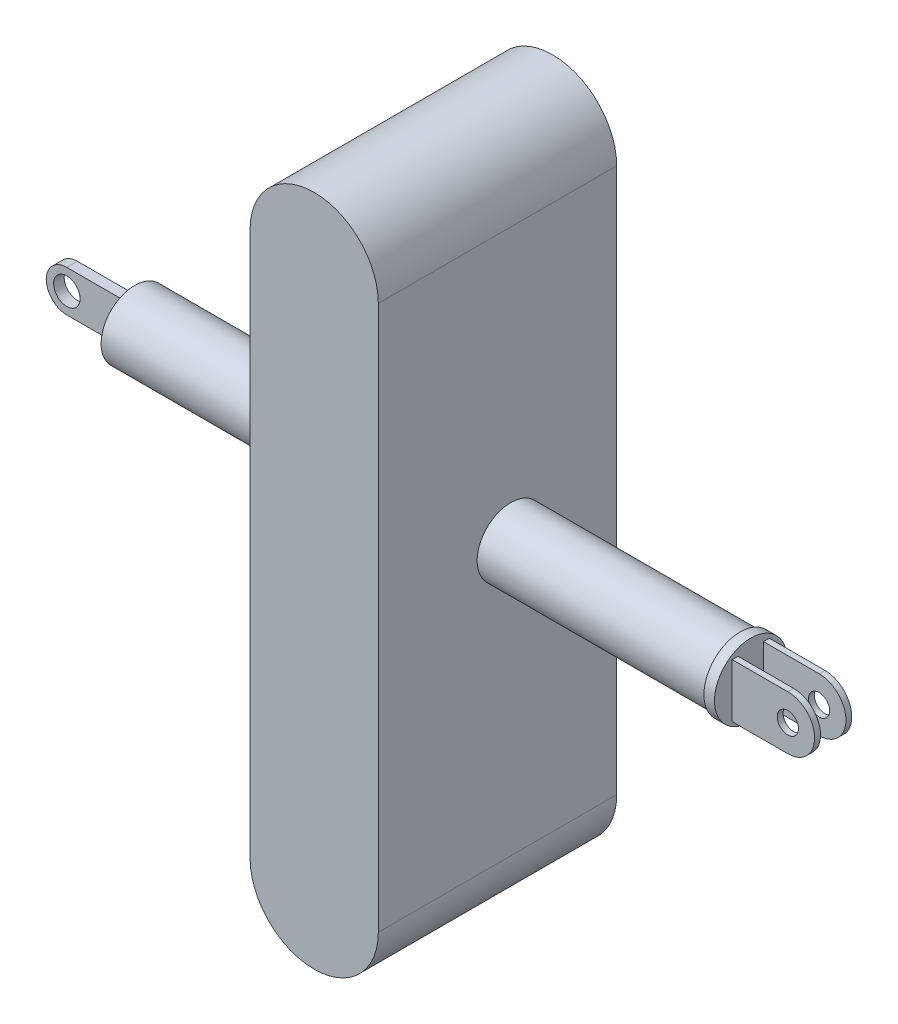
ISO-10303-21;
HEADER;
FILE_DESCRIPTION(('STEP AP214'),'2;1');
FILE_NAME('part.step','',(''),(''),'','','');
FILE_SCHEMA(('AUTOMOTIVE_DESIGN { 1 0 10303 214 1 1 1 1 }'));
ENDSEC;
DATA;
#1=APPLICATION_CONTEXT('core data for automotive mechanical design processes');
#2=APPLICATION_PROTOCOL_DEFINITION('international standard','automotive_design',2000,#1);
#3=PRODUCT_CONTEXT('',#1,'mechanical');
#4=PRODUCT('Part','Part','',(#3));
#5=PRODUCT_RELATED_PRODUCT_CATEGORY('part','',(#4));
#6=PRODUCT_DEFINITION_FORMATION('','',#4);
#7=PRODUCT_DEFINITION_CONTEXT('part definition',#1,'design');
#8=PRODUCT_DEFINITION('design','',#6,#7);
#9=PRODUCT_DEFINITION_SHAPE('','',#8);
#10=(LENGTH_UNIT() NAMED_UNIT(*) SI_UNIT(.MILLI.,.METRE.));
#11=(NAMED_UNIT(*) PLANE_ANGLE_UNIT() SI_UNIT($,.RADIAN.));
#12=(NAMED_UNIT(*) SI_UNIT($,.STERADIAN.) SOLID_ANGLE_UNIT());
#13=UNCERTAINTY_MEASURE_WITH_UNIT(LENGTH_MEASURE(1.E-05),#10,'distance_accuracy_value','');
#14=(GEOMETRIC_REPRESENTATION_CONTEXT(3) GLOBAL_UNCERTAINTY_ASSIGNED_CONTEXT((#13)) GLOBAL_UNIT_ASSIGNED_CONTEXT((#10,
#11,#12)) REPRESENTATION_CONTEXT('',''));
#15=CARTESIAN_POINT('',(0.,0.,0.));
#16=DIRECTION('',(0.,0.,1.));
#17=DIRECTION('',(1.,0.,0.));
#18=AXIS2_PLACEMENT_3D('',#15,#16,#17);
#19=CARTESIAN_POINT('',(228.6,0.,0.));
#20=DIRECTION('',(-1.,0.,0.));
#21=DIRECTION('',(0.,0.,1.));
#22=AXIS2_PLACEMENT_3D('',#19,#20,#21);
#23=CYLINDRICAL_SURFACE('',#22,12.7);
#24=CARTESIAN_POINT('',(228.6,0.,0.));
#25=DIRECTION('',(1.,0.,0.));
#26=DIRECTION('',(0.,0.,-1.));
#27=AXIS2_PLACEMENT_3D('',#24,#25,#26);
#28=CIRCLE('',#27,12.7);
#29=CARTESIAN_POINT('',(228.6,0.,12.7));
#30=VERTEX_POINT('',#29);
#31=EDGE_CURVE('E48',#30,#30,#28,.T.);
#32=CARTESIAN_POINT('',(141.979005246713,0.,0.));
#33=DIRECTION('',(-1.,0.,0.));
#34=DIRECTION('',(0.,0.,1.));
#35=AXIS2_PLACEMENT_3D('',#32,#33,#34);
#36=CIRCLE('',#35,12.7);
#37=CARTESIAN_POINT('',(141.979005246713,0.,12.7));
#38=VERTEX_POINT('',#37);
#39=EDGE_CURVE('E11',#38,#38,#36,.T.);
#40=CARTESIAN_POINT('',(228.6,0.,12.7));
#41=CARTESIAN_POINT('',(227.69769797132,0.,12.7));
#42=CARTESIAN_POINT('',(226.79539594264,0.,12.7));
#43=CARTESIAN_POINT('',(224.99079188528,0.,12.7));
#44=CARTESIAN_POINT('',(224.0884898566,0.,12.7));
#45=CARTESIAN_POINT('',(222.283885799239,0.,12.7));
#46=CARTESIAN_POINT('',(221.381583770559,0.,12.7));
#47=CARTESIAN_POINT('',(219.576979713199,0.,12.7));
#48=CARTESIAN_POINT('',(218.674677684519,0.,12.7));
#49=CARTESIAN_POINT('',(216.870073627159,0.,12.7));
#50=CARTESIAN_POINT('',(215.967771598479,0.,12.7));
#51=CARTESIAN_POINT('',(214.163167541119,0.,12.7));
#52=CARTESIAN_POINT('',(213.260865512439,0.,12.7));
#53=CARTESIAN_POINT('',(211.456261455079,0.,12.7));
#54=CARTESIAN_POINT('',(210.553959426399,0.,12.7));
#55=CARTESIAN_POINT('',(208.749355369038,0.,12.7));
#56=CARTESIAN_POINT('',(207.847053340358,0.,12.7));
#57=CARTESIAN_POINT('',(206.042449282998,0.,12.7));
#58=CARTESIAN_POINT('',(205.140147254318,0.,12.7));
#59=CARTESIAN_POINT('',(203.335543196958,0.,12.7));
#60=CARTESIAN_POINT('',(202.433241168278,0.,12.7));
#61=CARTESIAN_POINT('',(200.628637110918,0.,12.7));
#62=CARTESIAN_POINT('',(199.726335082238,0.,12.7));
#63=CARTESIAN_POINT('',(197.921731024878,0.,12.7));
#64=CARTESIAN_POINT('',(197.019428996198,0.,12.7));
#65=CARTESIAN_POINT('',(195.214824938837,0.,12.7));
#66=CARTESIAN_POINT('',(194.312522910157,0.,12.7));
#67=CARTESIAN_POINT('',(192.507918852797,0.,12.7));
#68=CARTESIAN_POINT('',(191.605616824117,0.,12.7));
#69=CARTESIAN_POINT('',(189.801012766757,0.,12.7));
#70=CARTESIAN_POINT('',(188.898710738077,0.,12.7));
#71=CARTESIAN_POINT('',(187.094106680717,0.,12.7));
#72=CARTESIAN_POINT('',(186.191804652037,0.,12.7));
#73=CARTESIAN_POINT('',(184.387200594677,0.,12.7));
#74=CARTESIAN_POINT('',(183.484898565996,0.,12.7));
#75=CARTESIAN_POINT('',(181.680294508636,0.,12.7));
#76=CARTESIAN_POINT('',(180.777992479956,0.,12.7));
#77=CARTESIAN_POINT('',(178.973388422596,0.,12.7));
#78=CARTESIAN_POINT('',(178.071086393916,0.,12.7));
#79=CARTESIAN_POINT('',(176.266482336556,0.,12.7));
#80=CARTESIAN_POINT('',(175.364180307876,0.,12.7));
#81=CARTESIAN_POINT('',(173.559576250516,0.,12.7));
#82=CARTESIAN_POINT('',(172.657274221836,0.,12.7));
#83=CARTESIAN_POINT('',(170.852670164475,0.,12.7));
#84=CARTESIAN_POINT('',(169.950368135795,0.,12.7));
#85=CARTESIAN_POINT('',(168.145764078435,0.,12.7));
#86=CARTESIAN_POINT('',(167.243462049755,0.,12.7));
#87=CARTESIAN_POINT('',(165.438857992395,0.,12.7));
#88=CARTESIAN_POINT('',(164.536555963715,0.,12.7));
#89=CARTESIAN_POINT('',(162.731951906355,0.,12.7));
#90=CARTESIAN_POINT('',(161.829649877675,0.,12.7));
#91=CARTESIAN_POINT('',(160.025045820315,0.,12.7));
#92=CARTESIAN_POINT('',(159.122743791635,0.,12.7));
#93=CARTESIAN_POINT('',(157.318139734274,0.,12.7));
#94=CARTESIAN_POINT('',(156.415837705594,0.,12.7));
#95=CARTESIAN_POINT('',(154.611233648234,0.,12.7));
#96=CARTESIAN_POINT('',(153.708931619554,0.,12.7));
#97=CARTESIAN_POINT('',(151.904327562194,0.,12.7));
#98=CARTESIAN_POINT('',(151.002025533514,0.,12.7));
#99=CARTESIAN_POINT('',(149.197421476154,0.,12.7));
#100=CARTESIAN_POINT('',(148.295119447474,0.,12.7));
#101=CARTESIAN_POINT('',(146.490515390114,0.,12.7));
#102=CARTESIAN_POINT('',(145.588213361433,0.,12.7));
#103=CARTESIAN_POINT('',(143.783609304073,0.,12.7));
#104=CARTESIAN_POINT('',(142.881307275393,0.,12.7));
#105=CARTESIAN_POINT('',(141.979005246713,0.,12.7));
#106=B_SPLINE_CURVE_WITH_KNOTS('',3,(#40,#41,#42,#43,#44,#45,#46,#47,#48,#49,#50,#51,#52,#53,
#54,#55,#56,#57,#58,#59,#60,#61,#62,#63,#64,#65,#66,#67,#68,#69,#70,#71,#72,#73,#74,#75,#76,#77,
#78,#79,#80,#81,#82,#83,#84,#85,#86,#87,#88,#89,#90,#91,#92,#93,#94,#95,#96,#97,#98,#99,#100,
#101,#102,#103,#104,#105),.UNSPECIFIED.,.F.,.F.,(4,2,2,2,2,2,2,2,2,2,2,2,2,2,2,2,2,2,2,2,2,2,2,
2,2,2,2,2,2,2,2,2,4),(0.,2.70690608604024,5.41381217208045,8.12071825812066,10.8276243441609,
13.5345304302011,16.2414365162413,18.9483426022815,21.6552486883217,24.3621547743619,
27.0690608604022,29.7759669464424,32.4828730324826,35.1897791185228,37.896685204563,
40.6035912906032,43.3104973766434,46.0174034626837,48.7243095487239,51.4312156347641,
54.1381217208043,56.8450278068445,59.5519338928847,62.258839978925,64.9657460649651,
67.6726521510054,70.3795582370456,73.0864643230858,75.793370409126,78.5002764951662,
81.2071825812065,83.9140886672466,86.6209947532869),.UNSPECIFIED.);
#107=EDGE_CURVE('BSEAM39',#30,#38,#106,.T.);
#108=ORIENTED_EDGE('',*,*,#31,.F.);
#109=ORIENTED_EDGE('',*,*,#39,.F.);
#110=ORIENTED_EDGE('',*,*,#107,.T.);
#111=ORIENTED_EDGE('',*,*,#107,.F.);
#112=EDGE_LOOP('',(#108,#110,#109,#111));
#113=FACE_BOUND('',#112,.T.);
#114=ADVANCED_FACE('F39',(#113),#23,.T.);
#115=CARTESIAN_POINT('',(232.6,-10.1328519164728,7.));
#116=DIRECTION('',(0.,1.,0.));
#117=DIRECTION('',(0.,0.,1.));
#118=AXIS2_PLACEMENT_3D('',#115,#116,#117);
#119=PLANE('',#118);
#120=DIRECTION('',(0.,0.,-1.));
#121=VECTOR('',#120,1.);
#122=CARTESIAN_POINT('',(253.6,-10.1328519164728,7.));
#123=LINE('',#122,#121);
#124=CARTESIAN_POINT('',(253.6,-10.1328519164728,-4.80121317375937));
#125=VERTEX_POINT('',#124);
#126=CARTESIAN_POINT('',(253.6,-10.1328519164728,-7.));
#127=VERTEX_POINT('',#126);
#128=EDGE_CURVE('E254',#125,#127,#123,.T.);
#129=ORIENTED_EDGE('',*,*,#128,.F.);
#130=DIRECTION('',(-1.,0.,0.));
#131=VECTOR('',#130,1.);
#132=CARTESIAN_POINT('',(232.6,-10.1328519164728,-4.80121317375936));
#133=LINE('',#132,#131);
#134=CARTESIAN_POINT('',(232.6,-10.1328519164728,-4.80121317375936));
#135=VERTEX_POINT('',#134);
#136=EDGE_CURVE('E217',#125,#135,#133,.T.);
#137=ORIENTED_EDGE('',*,*,#136,.T.);
#138=DIRECTION('',(0.,0.,-1.));
#139=VECTOR('',#138,1.);
#140=CARTESIAN_POINT('',(232.6,-10.1328519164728,7.));
#141=LINE('',#140,#139);
#142=CARTESIAN_POINT('',(232.6,-10.1328519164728,-7.));
#143=VERTEX_POINT('',#142);
#144=EDGE_CURVE('E258',#135,#143,#141,.T.);
#145=ORIENTED_EDGE('',*,*,#144,.T.);
#146=DIRECTION('',(1.,0.,0.));
#147=VECTOR('',#146,1.);
#148=CARTESIAN_POINT('',(232.6,-10.1328519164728,-7.));
#149=LINE('',#148,#147);
#150=EDGE_CURVE('E239',#143,#127,#149,.T.);
#151=ORIENTED_EDGE('',*,*,#150,.T.);
#152=EDGE_LOOP('',(#129,#137,#145,#151));
#153=FACE_BOUND('',#152,.T.);
#154=ADVANCED_FACE('F342',(#153),#119,.F.);
#155=CARTESIAN_POINT('',(253.6,0.,7.));
#156=DIRECTION('',(0.,0.,-1.));
#157=DIRECTION('',(-1.,0.,0.));
#158=AXIS2_PLACEMENT_3D('',#155,#156,#157);
#159=CYLINDRICAL_SURFACE('',#158,10.1328519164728);
#160=DIRECTION('',(0.,0.,-1.));
#161=VECTOR('',#160,1.);
#162=CARTESIAN_POINT('',(253.6,10.1328519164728,7.));
#163=LINE('',#162,#161);
#164=CARTESIAN_POINT('',(253.6,10.1328519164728,-4.80121317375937));
#165=VERTEX_POINT('',#164);
#166=CARTESIAN_POINT('',(253.6,10.1328519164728,-7.));
#167=VERTEX_POINT('',#166);
#168=EDGE_CURVE('E250',#165,#167,#163,.T.);
#169=ORIENTED_EDGE('',*,*,#168,.F.);
#170=CARTESIAN_POINT('',(253.6,0.,-4.80121317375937));
#171=DIRECTION('',(0.,0.,-1.));
#172=DIRECTION('',(-1.,0.,0.));
#173=AXIS2_PLACEMENT_3D('',#170,#171,#172);
#174=CIRCLE('',#173,10.1328519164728);
#175=EDGE_CURVE('E214',#165,#125,#174,.T.);
#176=ORIENTED_EDGE('',*,*,#175,.T.);
#177=ORIENTED_EDGE('',*,*,#128,.T.);
#178=CARTESIAN_POINT('',(253.6,0.,-7.));
#179=DIRECTION('',(0.,0.,1.));
#180=DIRECTION('',(-1.,0.,0.));
#181=AXIS2_PLACEMENT_3D('',#178,#179,#180);
#182=CIRCLE('',#181,10.1328519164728);
#183=EDGE_CURVE('E242',#127,#167,#182,.T.);
#184=ORIENTED_EDGE('',*,*,#183,.T.);
#185=EDGE_LOOP('',(#169,#176,#177,#184));
#186=FACE_BOUND('',#185,.T.);
#187=ADVANCED_FACE('F352',(#186),#159,.T.);
#188=CARTESIAN_POINT('',(232.6,10.1328519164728,7.));
#189=DIRECTION('',(0.,-1.,0.));
#190=DIRECTION('',(0.,0.,-1.));
#191=AXIS2_PLACEMENT_3D('',#188,#189,#190);
#192=PLANE('',#191);
#193=DIRECTION('',(0.,0.,-1.));
#194=VECTOR('',#193,1.);
#195=CARTESIAN_POINT('',(232.6,10.1328519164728,7.));
#196=LINE('',#195,#194);
#197=CARTESIAN_POINT('',(232.6,10.1328519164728,-4.80121317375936));
#198=VERTEX_POINT('',#197);
#199=CARTESIAN_POINT('',(232.6,10.1328519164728,-7.));
#200=VERTEX_POINT('',#199);
#201=EDGE_CURVE('E63',#198,#200,#196,.T.);
#202=ORIENTED_EDGE('',*,*,#201,.F.);
#203=DIRECTION('',(1.,0.,0.));
#204=VECTOR('',#203,1.);
#205=CARTESIAN_POINT('',(232.6,10.1328519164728,-4.80121317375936));
#206=LINE('',#205,#204);
#207=EDGE_CURVE('E211',#198,#165,#206,.T.);
#208=ORIENTED_EDGE('',*,*,#207,.T.);
#209=ORIENTED_EDGE('',*,*,#168,.T.);
#210=DIRECTION('',(-1.,0.,0.));
#211=VECTOR('',#210,1.);
#212=CARTESIAN_POINT('',(232.6,10.1328519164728,-7.));
#213=LINE('',#212,#211);
#214=EDGE_CURVE('E232',#167,#200,#213,.T.);
#215=ORIENTED_EDGE('',*,*,#214,.T.);
#216=EDGE_LOOP('',(#202,#208,#209,#215));
#217=FACE_BOUND('',#216,.T.);
#218=ADVANCED_FACE('F324',(#217),#192,.F.);
#219=CARTESIAN_POINT('',(253.6,0.,7.));
#220=DIRECTION('',(0.,0.,-1.));
#221=DIRECTION('',(-1.,0.,0.));
#222=AXIS2_PLACEMENT_3D('',#219,#220,#221);
#223=CYLINDRICAL_SURFACE('',#222,3.99999999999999);
#224=CARTESIAN_POINT('',(253.6,0.,-4.80121317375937));
#225=DIRECTION('',(0.,0.,-1.));
#226=DIRECTION('',(-1.,0.,0.));
#227=AXIS2_PLACEMENT_3D('',#224,#225,#226);
#228=CIRCLE('',#227,3.99999999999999);
#229=CARTESIAN_POINT('',(249.6,0.,-4.80121317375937));
#230=VERTEX_POINT('',#229);
#231=EDGE_CURVE('E210',#230,#230,#228,.T.);
#232=ORIENTED_EDGE('',*,*,#231,.F.);
#233=EDGE_LOOP('',(#232));
#234=FACE_BOUND('',#233,.T.);
#235=CARTESIAN_POINT('',(253.6,0.,-7.));
#236=DIRECTION('',(0.,0.,1.));
#237=DIRECTION('',(1.,0.,0.));
#238=AXIS2_PLACEMENT_3D('',#235,#236,#237);
#239=CIRCLE('',#238,3.99999999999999);
#240=CARTESIAN_POINT('',(257.6,0.,-7.));
#241=VERTEX_POINT('',#240);
#242=EDGE_CURVE('E220',#241,#241,#239,.T.);
#243=ORIENTED_EDGE('',*,*,#242,.F.);
#244=EDGE_LOOP('',(#243));
#245=FACE_BOUND('',#244,.T.);
#246=ADVANCED_FACE('F320',(#234,#245),#223,.F.);
#247=CARTESIAN_POINT('',(232.6,0.,0.));
#248=DIRECTION('',(1.,0.,0.));
#249=DIRECTION('',(0.,0.,-1.));
#250=AXIS2_PLACEMENT_3D('',#247,#248,#249);
#251=PLANE('',#250);
#252=ORIENTED_EDGE('',*,*,#144,.F.);
#253=DIRECTION('',(0.,1.,0.));
#254=VECTOR('',#253,1.);
#255=CARTESIAN_POINT('',(232.6,-13.7,-4.80121317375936));
#256=LINE('',#255,#254);
#257=EDGE_CURVE('E198',#135,#198,#256,.T.);
#258=ORIENTED_EDGE('',*,*,#257,.T.);
#259=ORIENTED_EDGE('',*,*,#201,.T.);
#260=DIRECTION('',(0.,-1.,0.));
#261=VECTOR('',#260,1.);
#262=CARTESIAN_POINT('',(232.6,10.1328519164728,-7.));
#263=LINE('',#262,#261);
#264=EDGE_CURVE('E225',#200,#143,#263,.T.);
#265=ORIENTED_EDGE('',*,*,#264,.T.);
#266=EDGE_LOOP('',(#252,#258,#259,#265));
#267=FACE_BOUND('',#266,.T.);
#268=CARTESIAN_POINT('',(232.6,10.1328519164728,7.));
#269=VERTEX_POINT('',#268);
#270=CARTESIAN_POINT('',(232.6,10.1328519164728,4.80121317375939));
#271=VERTEX_POINT('',#270);
#272=EDGE_CURVE('E247',#269,#271,#196,.T.);
#273=ORIENTED_EDGE('',*,*,#272,.T.);
#274=DIRECTION('',(0.,1.,0.));
#275=VECTOR('',#274,1.);
#276=CARTESIAN_POINT('',(232.6,-13.7,4.80121317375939));
#277=LINE('',#276,#275);
#278=CARTESIAN_POINT('',(232.6,-10.1328519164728,4.80121317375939));
#279=VERTEX_POINT('',#278);
#280=EDGE_CURVE('E55',#279,#271,#277,.T.);
#281=ORIENTED_EDGE('',*,*,#280,.F.);
#282=CARTESIAN_POINT('',(232.6,-10.1328519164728,7.));
#283=VERTEX_POINT('',#282);
#284=EDGE_CURVE('E259',#283,#279,#141,.T.);
#285=ORIENTED_EDGE('',*,*,#284,.F.);
#286=DIRECTION('',(0.,-1.,0.));
#287=VECTOR('',#286,1.);
#288=CARTESIAN_POINT('',(232.6,10.1328519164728,7.));
#289=LINE('',#288,#287);
#290=EDGE_CURVE('E228',#269,#283,#289,.T.);
#291=ORIENTED_EDGE('',*,*,#290,.F.);
#292=EDGE_LOOP('',(#273,#281,#285,#291));
#293=FACE_BOUND('',#292,.T.);
#294=CARTESIAN_POINT('',(232.6,0.,0.));
#295=DIRECTION('',(1.,0.,0.));
#296=DIRECTION('',(0.,0.,-1.));
#297=AXIS2_PLACEMENT_3D('',#294,#295,#296);
#298=CIRCLE('',#297,13.7);
#299=CARTESIAN_POINT('',(232.6,0.,-13.7));
#300=VERTEX_POINT('',#299);
#301=EDGE_CURVE('E263',#300,#300,#298,.T.);
#302=ORIENTED_EDGE('',*,*,#301,.T.);
#303=EDGE_LOOP('',(#302));
#304=FACE_BOUND('',#303,.T.);
#305=ADVANCED_FACE('F323',(#267,#293,#304),#251,.T.);
#306=CARTESIAN_POINT('',(228.6,0.,0.));
#307=DIRECTION('',(1.,0.,0.));
#308=DIRECTION('',(0.,0.,-1.));
#309=AXIS2_PLACEMENT_3D('',#306,#307,#308);
#310=PLANE('',#309);
#311=CARTESIAN_POINT('',(228.6,0.,0.));
#312=DIRECTION('',(1.,0.,0.));
#313=DIRECTION('',(0.,0.,-1.));
#314=AXIS2_PLACEMENT_3D('',#311,#312,#313);
#315=CIRCLE('',#314,13.7);
#316=CARTESIAN_POINT('',(228.6,0.,-13.7));
#317=VERTEX_POINT('',#316);
#318=EDGE_CURVE('E262',#317,#317,#315,.T.);
#319=ORIENTED_EDGE('',*,*,#318,.F.);
#320=EDGE_LOOP('',(#319));
#321=FACE_BOUND('',#320,.T.);
#322=ORIENTED_EDGE('',*,*,#31,.T.);
#323=EDGE_LOOP('',(#322));
#324=FACE_BOUND('',#323,.T.);
#325=ADVANCED_FACE('F413',(#321,#324),#310,.F.);
#326=CARTESIAN_POINT('',(232.6,0.,0.));
#327=DIRECTION('',(-1.,0.,0.));
#328=DIRECTION('',(0.,0.,1.));
#329=AXIS2_PLACEMENT_3D('',#326,#327,#328);
#330=CYLINDRICAL_SURFACE('',#329,13.7);
#331=ORIENTED_EDGE('',*,*,#301,.F.);
#332=EDGE_LOOP('',(#331));
#333=FACE_BOUND('',#332,.T.);
#334=ORIENTED_EDGE('',*,*,#318,.T.);
#335=EDGE_LOOP('',(#334));
#336=FACE_BOUND('',#335,.T.);
#337=ADVANCED_FACE('F343',(#333,#336),#330,.T.);
#338=CARTESIAN_POINT('',(253.6,0.,7.));
#339=DIRECTION('',(0.,0.,-1.));
#340=DIRECTION('',(-1.,0.,0.));
#341=AXIS2_PLACEMENT_3D('',#338,#339,#340);
#342=PLANE('',#341);
#343=ORIENTED_EDGE('',*,*,#290,.T.);
#344=DIRECTION('',(1.,0.,0.));
#345=VECTOR('',#344,1.);
#346=CARTESIAN_POINT('',(232.6,-10.1328519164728,7.));
#347=LINE('',#346,#345);
#348=CARTESIAN_POINT('',(253.6,-10.1328519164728,7.));
#349=VERTEX_POINT('',#348);
#350=EDGE_CURVE('E231',#283,#349,#347,.T.);
#351=ORIENTED_EDGE('',*,*,#350,.T.);
#352=CARTESIAN_POINT('',(253.6,0.,7.));
#353=DIRECTION('',(0.,0.,1.));
#354=DIRECTION('',(-1.,0.,0.));
#355=AXIS2_PLACEMENT_3D('',#352,#353,#354);
#356=CIRCLE('',#355,10.1328519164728);
#357=CARTESIAN_POINT('',(253.6,10.1328519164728,7.));
#358=VERTEX_POINT('',#357);
#359=EDGE_CURVE('E234',#349,#358,#356,.T.);
#360=ORIENTED_EDGE('',*,*,#359,.T.);
#361=DIRECTION('',(-1.,0.,0.));
#362=VECTOR('',#361,1.);
#363=CARTESIAN_POINT('',(232.6,10.1328519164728,7.));
#364=LINE('',#363,#362);
#365=EDGE_CURVE('E236',#358,#269,#364,.T.);
#366=ORIENTED_EDGE('',*,*,#365,.T.);
#367=EDGE_LOOP('',(#343,#351,#360,#366));
#368=FACE_BOUND('',#367,.T.);
#369=CARTESIAN_POINT('',(253.6,0.,7.));
#370=DIRECTION('',(0.,0.,1.));
#371=DIRECTION('',(1.,0.,0.));
#372=AXIS2_PLACEMENT_3D('',#369,#370,#371);
#373=CIRCLE('',#372,3.99999999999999);
#374=CARTESIAN_POINT('',(257.6,0.,7.));
#375=VERTEX_POINT('',#374);
#376=EDGE_CURVE('E221',#375,#375,#373,.T.);
#377=ORIENTED_EDGE('',*,*,#376,.F.);
#378=EDGE_LOOP('',(#377));
#379=FACE_BOUND('',#378,.T.);
#380=ADVANCED_FACE('F332',(#368,#379),#342,.F.);
#381=CARTESIAN_POINT('',(253.6,0.,-7.));
#382=DIRECTION('',(0.,0.,-1.));
#383=DIRECTION('',(-1.,0.,0.));
#384=AXIS2_PLACEMENT_3D('',#381,#382,#383);
#385=PLANE('',#384);
#386=ORIENTED_EDGE('',*,*,#264,.F.);
#387=ORIENTED_EDGE('',*,*,#214,.F.);
#388=ORIENTED_EDGE('',*,*,#183,.F.);
#389=ORIENTED_EDGE('',*,*,#150,.F.);
#390=EDGE_LOOP('',(#386,#387,#388,#389));
#391=FACE_BOUND('',#390,.T.);
#392=ORIENTED_EDGE('',*,*,#242,.T.);
#393=EDGE_LOOP('',(#392));
#394=FACE_BOUND('',#393,.T.);
#395=ADVANCED_FACE('F329',(#391,#394),#385,.T.);
#396=ORIENTED_EDGE('',*,*,#284,.T.);
#397=DIRECTION('',(1.,0.,0.));
#398=VECTOR('',#397,1.);
#399=CARTESIAN_POINT('',(232.6,-10.1328519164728,4.80121317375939));
#400=LINE('',#399,#398);
#401=CARTESIAN_POINT('',(253.6,-10.1328519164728,4.80121317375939));
#402=VERTEX_POINT('',#401);
#403=EDGE_CURVE('E207',#279,#402,#400,.T.);
#404=ORIENTED_EDGE('',*,*,#403,.T.);
#405=EDGE_CURVE('E255',#349,#402,#123,.T.);
#406=ORIENTED_EDGE('',*,*,#405,.F.);
#407=ORIENTED_EDGE('',*,*,#350,.F.);
#408=EDGE_LOOP('',(#396,#404,#406,#407));
#409=FACE_BOUND('',#408,.T.);
#410=ADVANCED_FACE('F331',(#409),#119,.F.);
#411=ORIENTED_EDGE('',*,*,#405,.T.);
#412=CARTESIAN_POINT('',(253.6,0.,4.80121317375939));
#413=DIRECTION('',(0.,0.,1.));
#414=DIRECTION('',(1.,0.,0.));
#415=AXIS2_PLACEMENT_3D('',#412,#413,#414);
#416=CIRCLE('',#415,10.1328519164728);
#417=CARTESIAN_POINT('',(253.6,10.1328519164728,4.80121317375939));
#418=VERTEX_POINT('',#417);
#419=EDGE_CURVE('E204',#402,#418,#416,.T.);
#420=ORIENTED_EDGE('',*,*,#419,.T.);
#421=EDGE_CURVE('E251',#358,#418,#163,.T.);
#422=ORIENTED_EDGE('',*,*,#421,.F.);
#423=ORIENTED_EDGE('',*,*,#359,.F.);
#424=EDGE_LOOP('',(#411,#420,#422,#423));
#425=FACE_BOUND('',#424,.T.);
#426=ADVANCED_FACE('F339',(#425),#159,.T.);
#427=ORIENTED_EDGE('',*,*,#421,.T.);
#428=DIRECTION('',(-1.,0.,0.));
#429=VECTOR('',#428,1.);
#430=CARTESIAN_POINT('',(232.6,10.1328519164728,4.80121317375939));
#431=LINE('',#430,#429);
#432=EDGE_CURVE('E202',#418,#271,#431,.T.);
#433=ORIENTED_EDGE('',*,*,#432,.T.);
#434=ORIENTED_EDGE('',*,*,#272,.F.);
#435=ORIENTED_EDGE('',*,*,#365,.F.);
#436=EDGE_LOOP('',(#427,#433,#434,#435));
#437=FACE_BOUND('',#436,.T.);
#438=ADVANCED_FACE('F421',(#437),#192,.F.);
#439=CARTESIAN_POINT('',(253.6,0.,4.80121317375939));
#440=DIRECTION('',(0.,0.,1.));
#441=DIRECTION('',(1.,0.,0.));
#442=AXIS2_PLACEMENT_3D('',#439,#440,#441);
#443=CIRCLE('',#442,3.99999999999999);
#444=CARTESIAN_POINT('',(257.6,0.,4.80121317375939));
#445=VERTEX_POINT('',#444);
#446=EDGE_CURVE('E200',#445,#445,#443,.T.);
#447=ORIENTED_EDGE('',*,*,#446,.F.);
#448=EDGE_LOOP('',(#447));
#449=FACE_BOUND('',#448,.T.);
#450=ORIENTED_EDGE('',*,*,#376,.T.);
#451=EDGE_LOOP('',(#450));
#452=FACE_BOUND('',#451,.T.);
#453=ADVANCED_FACE('F326',(#449,#452),#223,.F.);
#454=CARTESIAN_POINT('',(232.6,-13.7,-4.80121317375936));
#455=DIRECTION('',(0.,0.,-1.));
#456=DIRECTION('',(-1.,0.,0.));
#457=AXIS2_PLACEMENT_3D('',#454,#455,#456);
#458=PLANE('',#457);
#459=ORIENTED_EDGE('',*,*,#231,.T.);
#460=EDGE_LOOP('',(#459));
#461=FACE_BOUND('',#460,.T.);
#462=ORIENTED_EDGE('',*,*,#175,.F.);
#463=ORIENTED_EDGE('',*,*,#207,.F.);
#464=ORIENTED_EDGE('',*,*,#257,.F.);
#465=ORIENTED_EDGE('',*,*,#136,.F.);
#466=EDGE_LOOP('',(#462,#463,#464,#465));
#467=FACE_BOUND('',#466,.T.);
#468=ADVANCED_FACE('F317',(#461,#467),#458,.F.);
#469=CARTESIAN_POINT('',(232.6,-13.7,4.80121317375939));
#470=DIRECTION('',(0.,0.,1.));
#471=DIRECTION('',(1.,0.,0.));
#472=AXIS2_PLACEMENT_3D('',#469,#470,#471);
#473=PLANE('',#472);
#474=ORIENTED_EDGE('',*,*,#446,.T.);
#475=EDGE_LOOP('',(#474));
#476=FACE_BOUND('',#475,.T.);
#477=ORIENTED_EDGE('',*,*,#280,.T.);
#478=ORIENTED_EDGE('',*,*,#432,.F.);
#479=ORIENTED_EDGE('',*,*,#419,.F.);
#480=ORIENTED_EDGE('',*,*,#403,.F.);
#481=EDGE_LOOP('',(#477,#478,#479,#480));
#482=FACE_BOUND('',#481,.T.);
#483=ADVANCED_FACE('F443',(#476,#482),#473,.F.);
#484=CARTESIAN_POINT('',(93.5607065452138,-201.299374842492,50.));
#485=DIRECTION('',(-1.,0.,0.));
#486=DIRECTION('',(0.,0.,1.));
#487=AXIS2_PLACEMENT_3D('',#484,#485,#486);
#488=PLANE('',#487);
#489=DIRECTION('',(0.,0.,-1.));
#490=VECTOR('',#489,1.);
#491=CARTESIAN_POINT('',(93.5607065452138,102.813659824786,50.));
#492=LINE('',#491,#490);
#493=CARTESIAN_POINT('',(93.5607065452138,102.813659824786,50.));
#494=VERTEX_POINT('',#493);
#495=CARTESIAN_POINT('',(93.5607065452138,102.813659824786,-40.));
#496=VERTEX_POINT('',#495);
#497=EDGE_CURVE('E155',#494,#496,#492,.T.);
#498=ORIENTED_EDGE('',*,*,#497,.T.);
#499=DIRECTION('',(0.,1.,0.));
#500=VECTOR('',#499,1.);
#501=CARTESIAN_POINT('',(93.5607065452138,-201.299374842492,-40.));
#502=LINE('',#501,#500);
#503=CARTESIAN_POINT('',(93.5607065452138,-102.813659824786,-40.));
#504=VERTEX_POINT('',#503);
#505=EDGE_CURVE('E159',#504,#496,#502,.T.);
#506=ORIENTED_EDGE('',*,*,#505,.F.);
#507=DIRECTION('',(0.,0.,-1.));
#508=VECTOR('',#507,1.);
#509=CARTESIAN_POINT('',(93.5607065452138,-102.813659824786,50.));
#510=LINE('',#509,#508);
#511=CARTESIAN_POINT('',(93.5607065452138,-102.813659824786,50.));
#512=VERTEX_POINT('',#511);
#513=EDGE_CURVE('E166',#512,#504,#510,.T.);
#514=ORIENTED_EDGE('',*,*,#513,.F.);
#515=DIRECTION('',(0.,1.,0.));
#516=VECTOR('',#515,1.);
#517=CARTESIAN_POINT('',(93.5607065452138,-201.299374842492,50.));
#518=LINE('',#517,#516);
#519=EDGE_CURVE('E161',#512,#494,#518,.T.);
#520=ORIENTED_EDGE('',*,*,#519,.T.);
#521=EDGE_LOOP('',(#498,#506,#514,#520));
#522=FACE_BOUND('',#521,.T.);
#523=CARTESIAN_POINT('',(93.5607065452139,0.,0.));
#524=DIRECTION('',(-1.,0.,0.));
#525=DIRECTION('',(0.,0.,1.));
#526=AXIS2_PLACEMENT_3D('',#523,#524,#525);
#527=CIRCLE('',#526,12.7);
#528=CARTESIAN_POINT('',(93.5607065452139,0.,12.7));
#529=VERTEX_POINT('',#528);
#530=EDGE_CURVE('E43',#529,#529,#527,.T.);
#531=ORIENTED_EDGE('',*,*,#530,.F.);
#532=EDGE_LOOP('',(#531));
#533=FACE_BOUND('',#532,.T.);
#534=ADVANCED_FACE('F157',(#522,#533),#488,.T.);
#535=CARTESIAN_POINT('',(141.979005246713,-201.299374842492,50.));
#536=DIRECTION('',(-1.,0.,0.));
#537=DIRECTION('',(0.,0.,1.));
#538=AXIS2_PLACEMENT_3D('',#535,#536,#537);
#539=PLANE('',#538);
#540=DIRECTION('',(0.,0.,-1.));
#541=VECTOR('',#540,1.);
#542=CARTESIAN_POINT('',(141.979005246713,-102.813659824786,50.));
#543=LINE('',#542,#541);
#544=CARTESIAN_POINT('',(141.979005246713,-102.813659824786,50.));
#545=VERTEX_POINT('',#544);
#546=CARTESIAN_POINT('',(141.979005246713,-102.813659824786,-40.));
#547=VERTEX_POINT('',#546);
#548=EDGE_CURVE('E195',#545,#547,#543,.T.);
#549=ORIENTED_EDGE('',*,*,#548,.T.);
#550=DIRECTION('',(0.,1.,0.));
#551=VECTOR('',#550,1.);
#552=CARTESIAN_POINT('',(141.979005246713,-201.299374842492,-40.));
#553=LINE('',#552,#551);
#554=CARTESIAN_POINT('',(141.979005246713,102.813659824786,-40.));
#555=VERTEX_POINT('',#554);
#556=EDGE_CURVE('E184',#547,#555,#553,.T.);
#557=ORIENTED_EDGE('',*,*,#556,.T.);
#558=DIRECTION('',(0.,0.,-1.));
#559=VECTOR('',#558,1.);
#560=CARTESIAN_POINT('',(141.979005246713,102.813659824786,50.));
#561=LINE('',#560,#559);
#562=CARTESIAN_POINT('',(141.979005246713,102.813659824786,50.));
#563=VERTEX_POINT('',#562);
#564=EDGE_CURVE('E180',#563,#555,#561,.T.);
#565=ORIENTED_EDGE('',*,*,#564,.F.);
#566=DIRECTION('',(0.,1.,0.));
#567=VECTOR('',#566,1.);
#568=CARTESIAN_POINT('',(141.979005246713,-201.299374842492,50.));
#569=LINE('',#568,#567);
#570=EDGE_CURVE('E192',#545,#563,#569,.T.);
#571=ORIENTED_EDGE('',*,*,#570,.F.);
#572=EDGE_LOOP('',(#549,#557,#565,#571));
#573=FACE_BOUND('',#572,.T.);
#574=ORIENTED_EDGE('',*,*,#39,.T.);
#575=EDGE_LOOP('',(#574));
#576=FACE_BOUND('',#575,.T.);
#577=ADVANCED_FACE('F454',(#573,#576),#539,.F.);
#578=CARTESIAN_POINT('',(117.769855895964,102.813659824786,50.));
#579=DIRECTION('',(0.,0.,-1.));
#580=DIRECTION('',(-1.,0.,0.));
#581=AXIS2_PLACEMENT_3D('',#578,#579,#580);
#582=CYLINDRICAL_SURFACE('',#581,24.2091493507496);
#583=ORIENTED_EDGE('',*,*,#564,.T.);
#584=CARTESIAN_POINT('',(117.769855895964,102.813659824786,-40.));
#585=DIRECTION('',(0.,0.,1.));
#586=DIRECTION('',(1.,0.,0.));
#587=AXIS2_PLACEMENT_3D('',#584,#585,#586);
#588=CIRCLE('',#587,24.2091493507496);
#589=EDGE_CURVE('E173',#496,#555,#588,.F.);
#590=ORIENTED_EDGE('',*,*,#589,.F.);
#591=ORIENTED_EDGE('',*,*,#497,.F.);
#592=CARTESIAN_POINT('',(117.769855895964,102.813659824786,50.));
#593=DIRECTION('',(0.,0.,1.));
#594=DIRECTION('',(1.,0.,0.));
#595=AXIS2_PLACEMENT_3D('',#592,#593,#594);
#596=CIRCLE('',#595,24.2091493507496);
#597=EDGE_CURVE('E186',#494,#563,#596,.F.);
#598=ORIENTED_EDGE('',*,*,#597,.T.);
#599=EDGE_LOOP('',(#583,#590,#591,#598));
#600=FACE_BOUND('',#599,.T.);
#601=ADVANCED_FACE('F178',(#600),#582,.T.);
#602=CARTESIAN_POINT('',(117.769855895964,-102.813659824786,50.));
#603=DIRECTION('',(0.,0.,-1.));
#604=DIRECTION('',(-1.,0.,0.));
#605=AXIS2_PLACEMENT_3D('',#602,#603,#604);
#606=CYLINDRICAL_SURFACE('',#605,24.2091493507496);
#607=ORIENTED_EDGE('',*,*,#513,.T.);
#608=CARTESIAN_POINT('',(117.769855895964,-102.813659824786,-40.));
#609=DIRECTION('',(0.,0.,1.));
#610=DIRECTION('',(1.,0.,0.));
#611=AXIS2_PLACEMENT_3D('',#608,#609,#610);
#612=CIRCLE('',#611,24.2091493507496);
#613=EDGE_CURVE('E176',#547,#504,#612,.F.);
#614=ORIENTED_EDGE('',*,*,#613,.F.);
#615=ORIENTED_EDGE('',*,*,#548,.F.);
#616=CARTESIAN_POINT('',(117.769855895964,-102.813659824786,50.));
#617=DIRECTION('',(0.,0.,1.));
#618=DIRECTION('',(1.,0.,0.));
#619=AXIS2_PLACEMENT_3D('',#616,#617,#618);
#620=CIRCLE('',#619,24.2091493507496);
#621=EDGE_CURVE('E189',#545,#512,#620,.F.);
#622=ORIENTED_EDGE('',*,*,#621,.T.);
#623=EDGE_LOOP('',(#607,#614,#615,#622));
#624=FACE_BOUND('',#623,.T.);
#625=ADVANCED_FACE('F453',(#624),#606,.T.);
#626=CARTESIAN_POINT('',(117.769855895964,-201.299374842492,50.));
#627=DIRECTION('',(0.,0.,1.));
#628=DIRECTION('',(1.,0.,0.));
#629=AXIS2_PLACEMENT_3D('',#626,#627,#628);
#630=PLANE('',#629);
#631=ORIENTED_EDGE('',*,*,#597,.F.);
#632=ORIENTED_EDGE('',*,*,#519,.F.);
#633=ORIENTED_EDGE('',*,*,#621,.F.);
#634=ORIENTED_EDGE('',*,*,#570,.T.);
#635=EDGE_LOOP('',(#631,#632,#633,#634));
#636=FACE_BOUND('',#635,.T.);
#637=ADVANCED_FACE('F459',(#636),#630,.T.);
#638=CARTESIAN_POINT('',(117.769855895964,-201.299374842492,-40.));
#639=DIRECTION('',(0.,0.,1.));
#640=DIRECTION('',(1.,0.,0.));
#641=AXIS2_PLACEMENT_3D('',#638,#639,#640);
#642=PLANE('',#641);
#643=ORIENTED_EDGE('',*,*,#589,.T.);
#644=ORIENTED_EDGE('',*,*,#556,.F.);
#645=ORIENTED_EDGE('',*,*,#613,.T.);
#646=ORIENTED_EDGE('',*,*,#505,.T.);
#647=EDGE_LOOP('',(#643,#644,#645,#646));
#648=FACE_BOUND('',#647,.T.);
#649=ADVANCED_FACE('F171',(#648),#642,.F.);
#650=CARTESIAN_POINT('',(-23.6251254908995,0.,2.));
#651=DIRECTION('',(0.,0.,-1.));
#652=DIRECTION('',(-1.,0.,0.));
#653=AXIS2_PLACEMENT_3D('',#650,#651,#652);
#654=CYLINDRICAL_SURFACE('',#653,5.);
#655=CARTESIAN_POINT('',(-23.6251254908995,0.,2.));
#656=DIRECTION('',(0.,0.,1.));
#657=DIRECTION('',(1.,0.,0.));
#658=AXIS2_PLACEMENT_3D('',#655,#656,#657);
#659=CIRCLE('',#658,5.);
#660=CARTESIAN_POINT('',(-18.6251254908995,0.,2.));
#661=VERTEX_POINT('',#660);
#662=EDGE_CURVE('E270',#661,#661,#659,.T.);
#663=ORIENTED_EDGE('',*,*,#662,.T.);
#664=EDGE_LOOP('',(#663));
#665=FACE_BOUND('',#664,.T.);
#666=CARTESIAN_POINT('',(-23.6251254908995,0.,-2.));
#667=DIRECTION('',(0.,0.,1.));
#668=DIRECTION('',(1.,0.,0.));
#669=AXIS2_PLACEMENT_3D('',#666,#667,#668);
#670=CIRCLE('',#669,5.);
#671=CARTESIAN_POINT('',(-18.6251254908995,0.,-2.));
#672=VERTEX_POINT('',#671);
#673=EDGE_CURVE('E266',#672,#672,#670,.T.);
#674=ORIENTED_EDGE('',*,*,#673,.F.);
#675=EDGE_LOOP('',(#674));
#676=FACE_BOUND('',#675,.T.);
#677=ADVANCED_FACE('F391',(#665,#676),#654,.F.);
#678=CARTESIAN_POINT('',(-23.6251254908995,0.,2.));
#679=DIRECTION('',(0.,0.,-1.));
#680=DIRECTION('',(-1.,0.,0.));
#681=AXIS2_PLACEMENT_3D('',#678,#679,#680);
#682=CYLINDRICAL_SURFACE('',#681,7.77806758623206);
#683=CARTESIAN_POINT('',(-23.6251254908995,0.,-2.));
#684=DIRECTION('',(0.,0.,1.));
#685=DIRECTION('',(1.,0.,0.));
#686=AXIS2_PLACEMENT_3D('',#683,#684,#685);
#687=CIRCLE('',#686,7.77806758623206);
#688=CARTESIAN_POINT('',(-23.6251254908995,7.77806758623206,-2.));
#689=VERTEX_POINT('',#688);
#690=CARTESIAN_POINT('',(-23.6251254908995,-7.77806758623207,-2.));
#691=VERTEX_POINT('',#690);
#692=EDGE_CURVE('E292',#689,#691,#687,.T.);
#693=ORIENTED_EDGE('',*,*,#692,.T.);
#694=DIRECTION('',(0.,0.,-1.));
#695=VECTOR('',#694,1.);
#696=CARTESIAN_POINT('',(-23.6251254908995,-7.77806758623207,2.));
#697=LINE('',#696,#695);
#698=CARTESIAN_POINT('',(-23.6251254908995,-7.77806758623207,2.));
#699=VERTEX_POINT('',#698);
#700=EDGE_CURVE('E297',#699,#691,#697,.T.);
#701=ORIENTED_EDGE('',*,*,#700,.F.);
#702=CARTESIAN_POINT('',(-23.6251254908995,0.,2.));
#703=DIRECTION('',(0.,0.,1.));
#704=DIRECTION('',(1.,0.,0.));
#705=AXIS2_PLACEMENT_3D('',#702,#703,#704);
#706=CIRCLE('',#705,7.77806758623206);
#707=CARTESIAN_POINT('',(-23.6251254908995,7.77806758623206,2.));
#708=VERTEX_POINT('',#707);
#709=EDGE_CURVE('E283',#708,#699,#706,.T.);
#710=ORIENTED_EDGE('',*,*,#709,.F.);
#711=DIRECTION('',(0.,0.,-1.));
#712=VECTOR('',#711,1.);
#713=CARTESIAN_POINT('',(-23.6251254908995,7.77806758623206,2.));
#714=LINE('',#713,#712);
#715=EDGE_CURVE('E300',#708,#689,#714,.T.);
#716=ORIENTED_EDGE('',*,*,#715,.T.);
#717=EDGE_LOOP('',(#693,#701,#710,#716));
#718=FACE_BOUND('',#717,.T.);
#719=ADVANCED_FACE('F389',(#718),#682,.T.);
#720=CARTESIAN_POINT('',(-23.6251254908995,0.,-2.));
#721=DIRECTION('',(0.,0.,1.));
#722=DIRECTION('',(1.,0.,0.));
#723=AXIS2_PLACEMENT_3D('',#720,#721,#722);
#724=PLANE('',#723);
#725=DIRECTION('',(0.,1.,0.));
#726=VECTOR('',#725,1.);
#727=CARTESIAN_POINT('',(0.,7.77806758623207,-2.));
#728=LINE('',#727,#726);
#729=CARTESIAN_POINT('',(0.,-7.77806758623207,-2.));
#730=VERTEX_POINT('',#729);
#731=CARTESIAN_POINT('',(0.,7.77806758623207,-2.));
#732=VERTEX_POINT('',#731);
#733=EDGE_CURVE('E274',#730,#732,#728,.T.);
#734=ORIENTED_EDGE('',*,*,#733,.F.);
#735=DIRECTION('',(1.,0.,0.));
#736=VECTOR('',#735,1.);
#737=CARTESIAN_POINT('',(0.,-7.77806758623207,-2.));
#738=LINE('',#737,#736);
#739=EDGE_CURVE('E281',#691,#730,#738,.T.);
#740=ORIENTED_EDGE('',*,*,#739,.F.);
#741=ORIENTED_EDGE('',*,*,#692,.F.);
#742=DIRECTION('',(-1.,0.,0.));
#743=VECTOR('',#742,1.);
#744=CARTESIAN_POINT('',(0.,7.77806758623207,-2.));
#745=LINE('',#744,#743);
#746=EDGE_CURVE('E290',#732,#689,#745,.T.);
#747=ORIENTED_EDGE('',*,*,#746,.F.);
#748=EDGE_LOOP('',(#734,#740,#741,#747));
#749=FACE_BOUND('',#748,.T.);
#750=ORIENTED_EDGE('',*,*,#673,.T.);
#751=EDGE_LOOP('',(#750));
#752=FACE_BOUND('',#751,.T.);
#753=ADVANCED_FACE('F386',(#749,#752),#724,.F.);
#754=CARTESIAN_POINT('',(0.,-7.77806758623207,2.));
#755=DIRECTION('',(0.,1.,0.));
#756=DIRECTION('',(-1.,0.,0.));
#757=AXIS2_PLACEMENT_3D('',#754,#755,#756);
#758=PLANE('',#757);
#759=ORIENTED_EDGE('',*,*,#739,.T.);
#760=DIRECTION('',(0.,0.,-1.));
#761=VECTOR('',#760,1.);
#762=CARTESIAN_POINT('',(0.,-7.77806758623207,2.));
#763=LINE('',#762,#761);
#764=CARTESIAN_POINT('',(0.,-7.77806758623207,2.));
#765=VERTEX_POINT('',#764);
#766=EDGE_CURVE('E288',#765,#730,#763,.T.);
#767=ORIENTED_EDGE('',*,*,#766,.F.);
#768=DIRECTION('',(1.,0.,0.));
#769=VECTOR('',#768,1.);
#770=CARTESIAN_POINT('',(0.,-7.77806758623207,2.));
#771=LINE('',#770,#769);
#772=EDGE_CURVE('E285',#699,#765,#771,.T.);
#773=ORIENTED_EDGE('',*,*,#772,.F.);
#774=ORIENTED_EDGE('',*,*,#700,.T.);
#775=EDGE_LOOP('',(#759,#767,#773,#774));
#776=FACE_BOUND('',#775,.T.);
#777=ADVANCED_FACE('F382',(#776),#758,.F.);
#778=CARTESIAN_POINT('',(-23.6251254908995,0.,2.));
#779=DIRECTION('',(0.,0.,1.));
#780=DIRECTION('',(1.,0.,0.));
#781=AXIS2_PLACEMENT_3D('',#778,#779,#780);
#782=PLANE('',#781);
#783=DIRECTION('',(0.,1.,0.));
#784=VECTOR('',#783,1.);
#785=CARTESIAN_POINT('',(0.,7.77806758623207,2.));
#786=LINE('',#785,#784);
#787=CARTESIAN_POINT('',(0.,7.77806758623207,2.));
#788=VERTEX_POINT('',#787);
#789=EDGE_CURVE('E277',#765,#788,#786,.T.);
#790=ORIENTED_EDGE('',*,*,#789,.T.);
#791=DIRECTION('',(-1.,0.,0.));
#792=VECTOR('',#791,1.);
#793=CARTESIAN_POINT('',(0.,7.77806758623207,2.));
#794=LINE('',#793,#792);
#795=EDGE_CURVE('E280',#788,#708,#794,.T.);
#796=ORIENTED_EDGE('',*,*,#795,.T.);
#797=ORIENTED_EDGE('',*,*,#709,.T.);
#798=ORIENTED_EDGE('',*,*,#772,.T.);
#799=EDGE_LOOP('',(#790,#796,#797,#798));
#800=FACE_BOUND('',#799,.T.);
#801=ORIENTED_EDGE('',*,*,#662,.F.);
#802=EDGE_LOOP('',(#801));
#803=FACE_BOUND('',#802,.T.);
#804=ADVANCED_FACE('F376',(#800,#803),#782,.T.);
#805=CARTESIAN_POINT('',(0.,7.77806758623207,2.));
#806=DIRECTION('',(0.,-1.,0.));
#807=DIRECTION('',(1.,0.,0.));
#808=AXIS2_PLACEMENT_3D('',#805,#806,#807);
#809=PLANE('',#808);
#810=ORIENTED_EDGE('',*,*,#746,.T.);
#811=ORIENTED_EDGE('',*,*,#715,.F.);
#812=ORIENTED_EDGE('',*,*,#795,.F.);
#813=DIRECTION('',(0.,0.,-1.));
#814=VECTOR('',#813,1.);
#815=CARTESIAN_POINT('',(0.,7.77806758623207,2.));
#816=LINE('',#815,#814);
#817=EDGE_CURVE('E303',#788,#732,#816,.T.);
#818=ORIENTED_EDGE('',*,*,#817,.T.);
#819=EDGE_LOOP('',(#810,#811,#812,#818));
#820=FACE_BOUND('',#819,.T.);
#821=ADVANCED_FACE('F362',(#820),#809,.F.);
#822=CARTESIAN_POINT('',(0.,0.,0.));
#823=DIRECTION('',(1.,0.,0.));
#824=DIRECTION('',(0.,0.,-1.));
#825=AXIS2_PLACEMENT_3D('',#822,#823,#824);
#826=PLANE('',#825);
#827=CARTESIAN_POINT('',(0.,0.,0.));
#828=DIRECTION('',(1.,0.,0.));
#829=DIRECTION('',(0.,0.,-1.));
#830=AXIS2_PLACEMENT_3D('',#827,#828,#829);
#831=CIRCLE('',#830,12.7);
#832=CARTESIAN_POINT('',(0.,0.,12.7));
#833=VERTEX_POINT('',#832);
#834=EDGE_CURVE('E306',#833,#833,#831,.T.);
#835=ORIENTED_EDGE('',*,*,#834,.F.);
#836=EDGE_LOOP('',(#835));
#837=FACE_BOUND('',#836,.T.);
#838=ORIENTED_EDGE('',*,*,#817,.F.);
#839=ORIENTED_EDGE('',*,*,#789,.F.);
#840=ORIENTED_EDGE('',*,*,#766,.T.);
#841=ORIENTED_EDGE('',*,*,#733,.T.);
#842=EDGE_LOOP('',(#838,#839,#840,#841));
#843=FACE_BOUND('',#842,.T.);
#844=ADVANCED_FACE('F357',(#837,#843),#826,.F.);
#845=CARTESIAN_POINT('',(93.5607065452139,0.,12.7));
#846=CARTESIAN_POINT('',(92.5861158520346,0.,12.7));
#847=CARTESIAN_POINT('',(91.6115251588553,0.,12.7));
#848=CARTESIAN_POINT('',(89.6623437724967,0.,12.7));
#849=CARTESIAN_POINT('',(88.6877530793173,0.,12.7));
#850=CARTESIAN_POINT('',(86.7385716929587,0.,12.7));
#851=CARTESIAN_POINT('',(85.7639809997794,0.,12.7));
#852=CARTESIAN_POINT('',(83.8147996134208,0.,12.7));
#853=CARTESIAN_POINT('',(82.8402089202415,0.,12.7));
#854=CARTESIAN_POINT('',(80.8910275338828,0.,12.7));
#855=CARTESIAN_POINT('',(79.9164368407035,0.,12.7));
#856=CARTESIAN_POINT('',(77.9672554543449,0.,12.7));
#857=CARTESIAN_POINT('',(76.9926647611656,0.,12.7));
#858=CARTESIAN_POINT('',(75.043483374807,0.,12.7));
#859=CARTESIAN_POINT('',(74.0688926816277,0.,12.7));
#860=CARTESIAN_POINT('',(72.119711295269,0.,12.7));
#861=CARTESIAN_POINT('',(71.1451206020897,0.,12.7));
#862=CARTESIAN_POINT('',(69.1959392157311,0.,12.7));
#863=CARTESIAN_POINT('',(68.2213485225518,0.,12.7));
#864=CARTESIAN_POINT('',(66.2721671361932,0.,12.7));
#865=CARTESIAN_POINT('',(65.2975764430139,0.,12.7));
#866=CARTESIAN_POINT('',(63.3483950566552,0.,12.7));
#867=CARTESIAN_POINT('',(62.3738043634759,0.,12.7));
#868=CARTESIAN_POINT('',(60.4246229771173,0.,12.7));
#869=CARTESIAN_POINT('',(59.450032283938,0.,12.7));
#870=CARTESIAN_POINT('',(57.5008508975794,0.,12.7));
#871=CARTESIAN_POINT('',(56.5262602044,0.,12.7));
#872=CARTESIAN_POINT('',(54.5770788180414,0.,12.7));
#873=CARTESIAN_POINT('',(53.6024881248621,0.,12.7));
#874=CARTESIAN_POINT('',(51.6533067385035,0.,12.7));
#875=CARTESIAN_POINT('',(50.6787160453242,0.,12.7));
#876=CARTESIAN_POINT('',(48.7295346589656,0.,12.7));
#877=CARTESIAN_POINT('',(47.7549439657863,0.,12.7));
#878=CARTESIAN_POINT('',(45.8057625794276,0.,12.7));
#879=CARTESIAN_POINT('',(44.8311718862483,0.,12.7));
#880=CARTESIAN_POINT('',(42.8819904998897,0.,12.7));
#881=CARTESIAN_POINT('',(41.9073998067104,0.,12.7));
#882=CARTESIAN_POINT('',(39.9582184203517,0.,12.7));
#883=CARTESIAN_POINT('',(38.9836277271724,0.,12.7));
#884=CARTESIAN_POINT('',(37.0344463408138,0.,12.7));
#885=CARTESIAN_POINT('',(36.0598556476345,0.,12.7));
#886=CARTESIAN_POINT('',(34.1106742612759,0.,12.7));
#887=CARTESIAN_POINT('',(33.1360835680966,0.,12.7));
#888=CARTESIAN_POINT('',(31.1869021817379,0.,12.7));
#889=CARTESIAN_POINT('',(30.2123114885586,0.,12.7));
#890=CARTESIAN_POINT('',(28.2631301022,0.,12.7));
#891=CARTESIAN_POINT('',(27.2885394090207,0.,12.7));
#892=CARTESIAN_POINT('',(25.3393580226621,0.,12.7));
#893=CARTESIAN_POINT('',(24.3647673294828,0.,12.7));
#894=CARTESIAN_POINT('',(22.4155859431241,0.,12.7));
#895=CARTESIAN_POINT('',(21.4409952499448,0.,12.7));
#896=CARTESIAN_POINT('',(19.4918138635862,0.,12.7));
#897=CARTESIAN_POINT('',(18.5172231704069,0.,12.7));
#898=CARTESIAN_POINT('',(16.5680417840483,0.,12.7));
#899=CARTESIAN_POINT('',(15.593451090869,0.,12.7));
#900=CARTESIAN_POINT('',(13.6442697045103,0.,12.7));
#901=CARTESIAN_POINT('',(12.669679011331,0.,12.7));
#902=CARTESIAN_POINT('',(10.7204976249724,0.,12.7));
#903=CARTESIAN_POINT('',(9.7459069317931,0.,12.7));
#904=CARTESIAN_POINT('',(7.79672554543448,0.,12.7));
#905=CARTESIAN_POINT('',(6.82213485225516,0.,12.7));
#906=CARTESIAN_POINT('',(4.87295346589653,0.,12.7));
#907=CARTESIAN_POINT('',(3.89836277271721,0.,12.7));
#908=CARTESIAN_POINT('',(1.94918138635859,0.,12.7));
#909=CARTESIAN_POINT('',(0.974590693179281,0.,12.7));
#910=CARTESIAN_POINT('',(0.,0.,12.7));
#911=B_SPLINE_CURVE_WITH_KNOTS('',3,(#845,#846,#847,#848,#849,#850,#851,#852,#853,#854,#855,
#856,#857,#858,#859,#860,#861,#862,#863,#864,#865,#866,#867,#868,#869,#870,#871,#872,#873,#874,
#875,#876,#877,#878,#879,#880,#881,#882,#883,#884,#885,#886,#887,#888,#889,#890,#891,#892,#893,
#894,#895,#896,#897,#898,#899,#900,#901,#902,#903,#904,#905,#906,#907,#908,#909,#910),
.UNSPECIFIED.,.F.,.F.,(4,2,2,2,2,2,2,2,2,2,2,2,2,2,2,2,2,2,2,2,2,2,2,2,2,2,2,2,2,2,2,2,4),(0.,
2.92377207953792,5.84754415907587,8.7713162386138,11.6950883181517,14.6188603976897,
17.5426324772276,20.4664045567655,23.3901766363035,26.3139487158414,29.2377207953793,
32.1614928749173,35.0852649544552,38.0090370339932,40.9328091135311,43.856581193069,
46.780353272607,49.7041253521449,52.6278974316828,55.5516695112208,58.4754415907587,
61.3992136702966,64.3229857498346,67.2467578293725,70.1705299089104,73.0943019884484,
76.0180740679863,78.9418461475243,81.8656182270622,84.7893903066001,87.7131623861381,
90.636934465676,93.5607065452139),.UNSPECIFIED.);
#912=EDGE_CURVE('BSEAM41',#529,#833,#911,.T.);
#913=ORIENTED_EDGE('',*,*,#530,.T.);
#914=ORIENTED_EDGE('',*,*,#834,.T.);
#915=ORIENTED_EDGE('',*,*,#912,.T.);
#916=ORIENTED_EDGE('',*,*,#912,.F.);
#917=EDGE_LOOP('',(#913,#915,#914,#916));
#918=FACE_BOUND('',#917,.T.);
#919=ADVANCED_FACE('F41',(#918),#23,.T.);
#920=CLOSED_SHELL('',(#114,#154,#187,#218,#246,#305,#325,#337,#380,#395,#410,#426,#438,#453,
#468,#483,#534,#577,#601,#625,#637,#649,#677,#719,#753,#777,#804,#821,#844,#919));
#921=MANIFOLD_SOLID_BREP('B2',#920);
#922=ADVANCED_BREP_SHAPE_REPRESENTATION('',(#18,#921),#14);
#923=SHAPE_DEFINITION_REPRESENTATION(#9,#922);
ENDSEC;
END-ISO-10303-21;
